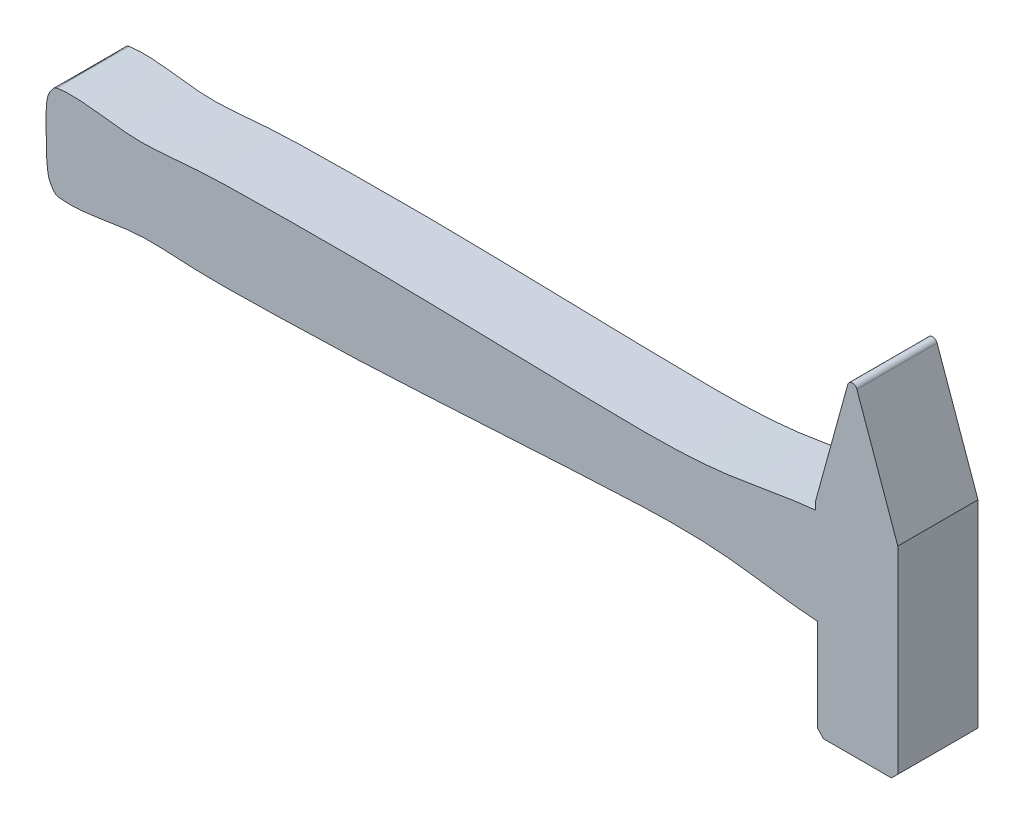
from build123d import *

# Parameters (mm, degrees)
BOSS_EXTRU_1_DEPTH      = 33.4
CONG_1_R                = 2
ENL_V_MAT_EXTRU_1_DEPTH = 3.33


with BuildPart() as part:
    # Esquisse1 → Boss.-Extru.1 (new body)
    with BuildSketch(Plane.XY):
        with BuildLine():
            Line((0, 0), (0, 38.505510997))
            add(Edge.make_bspline(
                [(0, 38.505510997), (-12.992910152, 39.265137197), (-32.872622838, 43.172369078), (-62.322833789, 43.991821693), (-92.949048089, 42.495252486), (-137.627098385, 40.045196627), (-185.301385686, 37.015745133), (-228.892410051, 35.927652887), (-258.766698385, 35.321408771), (-283.178375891, 37.506686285), (-301.247067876, 33.550196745), (-312.011770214, 32.889647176), (-316.154687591, 33.365918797)],
                knots=[0, 0, 0, 0, 0.123173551, 0.190951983, 0.278444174, 0.413498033, 0.614695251, 0.730775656, 0.826275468, 0.89791465, 0.961054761, 1, 1, 1, 1], degree=3))
            add(Edge.make_bspline(
                [(-321.218635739, 52.813524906), (-321.20376202, 49.420119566), (-321.165898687, 44.191204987), (-320.287800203, 37.70671183), (-318.214716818, 34.690320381), (-316.906896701, 33.45239309), (-316.154687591, 33.365918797)],
                knots=[0, 0, 0, 0, 0.479345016, 0.759127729, 0.899247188, 1, 1, 1, 1], degree=3))
            add(Edge.make_bspline(
                [(-321.218635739, 52.813524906), (-321.320797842, 56.205424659), (-321.463284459, 61.43253465), (-320.809336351, 67.943453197), (-318.841511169, 71.029543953), (-317.577160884, 72.31183713), (-316.828381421, 72.424201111)],
                knots=[0, 0, 0, 0, 0.479345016, 0.759127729, 0.899247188, 1, 1, 1, 1], degree=3))
            add(Edge.make_bspline(
                [(-0.684508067, 78.190762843), (-13.643492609, 76.983507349), (-33.376632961, 72.393016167), (-62.781065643, 70.55841368), (-93.440673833, 70.997899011), (-138.176641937, 71.905703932), (-185.927046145, 73.289229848), (-229.529665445, 72.873369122), (-259.407090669, 72.448990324), (-283.728884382, 69.423137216), (-301.923274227, 72.75414573), (-312.704353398, 73.043064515), (-316.828381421, 72.424201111)],
                knots=[0, 0, 0, 0, 0.123173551, 0.190951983, 0.278444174, 0.413498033, 0.614695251, 0.730775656, 0.826275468, 0.89791465, 0.961054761, 1, 1, 1, 1], degree=3))
            Line((-0.684508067, 78.190762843), (-0.684508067, 81.696129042))
            Line((-0.684508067, 81.696129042), (14.354464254, 136.362398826))
            Line((14.354464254, 136.362398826), (33.528156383, 82.361170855))
            Line((33.528156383, 82.361170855), (33.528156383, 0))
            Line((33.528156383, 0), (30.828393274, -2.638829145))
            Line((30.828393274, -2.638829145), (2.579270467, -2.638829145))
            Line((2.579270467, -2.638829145), (0, 0))
        make_face()
    extrude(amount=BOSS_EXTRU_1_DEPTH)

    # Cong_1
    cong_1_edges = [part.edges().sort_by_distance(p)[0] for p in [
        (14.354464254, 136.362398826, 16.7),
    ]]
    fillet(cong_1_edges, radius=CONG_1_R)

    # Esquisse3 → Enl_v. mat.-Extru.1 (cut)
    with BuildSketch(Plane(origin=(0, 0, 0), x_dir=(-1, 0, 0), z_dir=(0, 0, -1))):
        with BuildLine():
            Line((0.684508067, 78.190762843), (0, 38.505510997))
            add(Edge.make_bspline(
                [(316.154687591, 33.365918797), (312.011770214, 32.889647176), (301.247067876, 33.550196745), (283.178375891, 37.506686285), (258.766698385, 35.321408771), (228.892410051, 35.927652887), (185.301385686, 37.015745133), (137.627098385, 40.045196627), (92.949048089, 42.495252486), (62.322833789, 43.991821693), (32.872622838, 43.172369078), (12.992910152, 39.265137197), (0, 38.505510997)],
                knots=[0, 0, 0, 0, 0.038945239, 0.10208535, 0.173724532, 0.269224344, 0.385304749, 0.586501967, 0.721555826, 0.809048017, 0.876826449, 1, 1, 1, 1], degree=3))
            add(Edge.make_bspline(
                [(321.218635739, 52.813524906), (321.20376202, 49.420119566), (321.165898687, 44.191204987), (320.287800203, 37.70671183), (318.214716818, 34.690320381), (316.906896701, 33.45239309), (316.154687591, 33.365918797)],
                knots=[0, 0, 0, 0, 0.479345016, 0.759127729, 0.899247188, 1, 1, 1, 1], degree=3))
            add(Edge.make_bspline(
                [(316.828381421, 72.424201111), (317.577160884, 72.31183713), (318.841511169, 71.029543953), (320.809336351, 67.943453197), (321.463284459, 61.43253465), (321.320797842, 56.205424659), (321.218635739, 52.813524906)],
                knots=[0, 0, 0, 0, 0.100752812, 0.240872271, 0.520654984, 1, 1, 1, 1], degree=3))
            add(Edge.make_bspline(
                [(0.684508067, 78.190762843), (13.643492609, 76.983507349), (33.376632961, 72.393016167), (62.781065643, 70.55841368), (93.440673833, 70.997899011), (138.176641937, 71.905703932), (185.927046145, 73.289229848), (229.529665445, 72.873369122), (259.407090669, 72.448990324), (283.728884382, 69.423137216), (301.923274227, 72.75414573), (312.704353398, 73.043064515), (316.828381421, 72.424201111)],
                knots=[0, 0, 0, 0, 0.123173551, 0.190951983, 0.278444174, 0.413498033, 0.614695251, 0.730775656, 0.826275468, 0.89791465, 0.961054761, 1, 1, 1, 1], degree=3))
        make_face()
    extrude(amount=-ENL_V_MAT_EXTRU_1_DEPTH, mode=Mode.SUBTRACT)


solid = part.part
